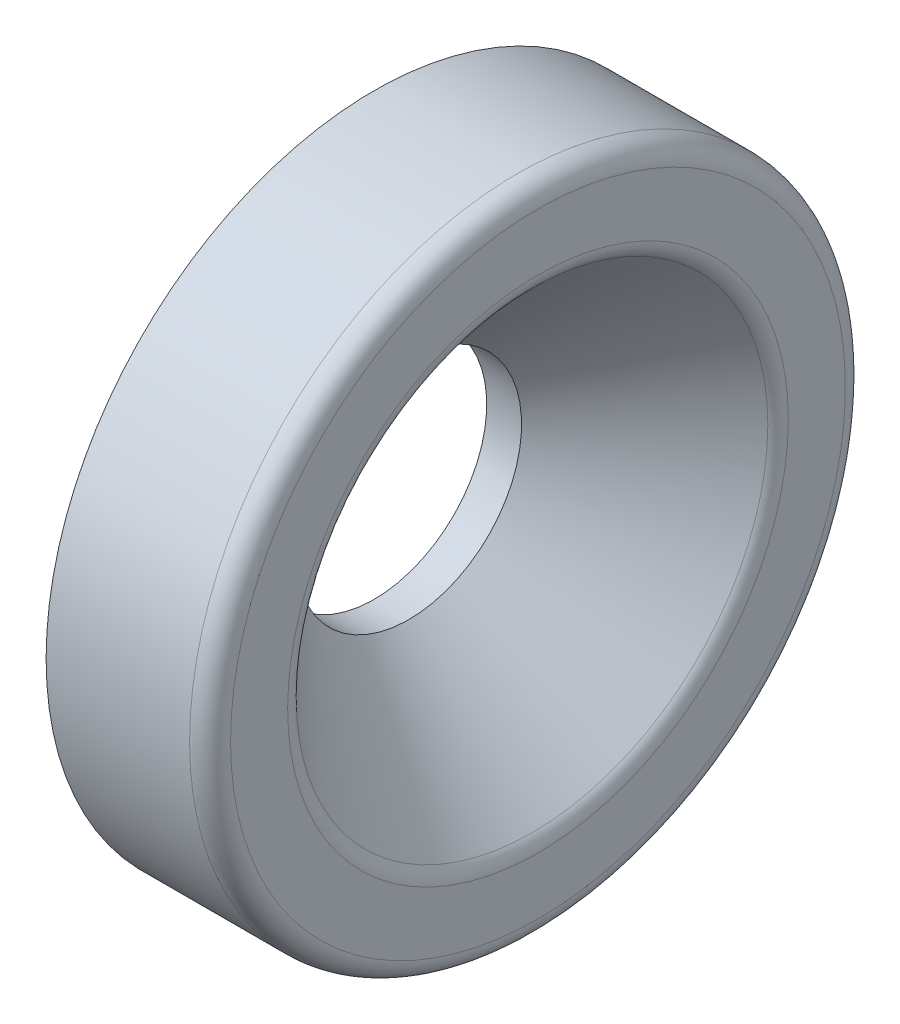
ISO-10303-21;
HEADER;
FILE_DESCRIPTION(('STEP AP214'),'2;1');
FILE_NAME('part.step','',(''),(''),'','','');
FILE_SCHEMA(('AUTOMOTIVE_DESIGN { 1 0 10303 214 1 1 1 1 }'));
ENDSEC;
DATA;
#1=APPLICATION_CONTEXT('core data for automotive mechanical design processes');
#2=APPLICATION_PROTOCOL_DEFINITION('international standard','automotive_design',2000,#1);
#3=PRODUCT_CONTEXT('',#1,'mechanical');
#4=PRODUCT('Part','Part','',(#3));
#5=PRODUCT_RELATED_PRODUCT_CATEGORY('part','',(#4));
#6=PRODUCT_DEFINITION_FORMATION('','',#4);
#7=PRODUCT_DEFINITION_CONTEXT('part definition',#1,'design');
#8=PRODUCT_DEFINITION('design','',#6,#7);
#9=PRODUCT_DEFINITION_SHAPE('','',#8);
#10=(LENGTH_UNIT() NAMED_UNIT(*) SI_UNIT(.MILLI.,.METRE.));
#11=(NAMED_UNIT(*) PLANE_ANGLE_UNIT() SI_UNIT($,.RADIAN.));
#12=(NAMED_UNIT(*) SI_UNIT($,.STERADIAN.) SOLID_ANGLE_UNIT());
#13=UNCERTAINTY_MEASURE_WITH_UNIT(LENGTH_MEASURE(1.E-05),#10,'distance_accuracy_value','');
#14=(GEOMETRIC_REPRESENTATION_CONTEXT(3) GLOBAL_UNCERTAINTY_ASSIGNED_CONTEXT((#13)) GLOBAL_UNIT_ASSIGNED_CONTEXT((#10,
#11,#12)) REPRESENTATION_CONTEXT('',''));
#15=CARTESIAN_POINT('',(0.,0.,0.));
#16=DIRECTION('',(0.,0.,1.));
#17=DIRECTION('',(1.,0.,0.));
#18=AXIS2_PLACEMENT_3D('',#15,#16,#17);
#19=CARTESIAN_POINT('',(0.,0.,0.));
#20=DIRECTION('',(-1.,0.,0.));
#21=DIRECTION('',(0.,0.,1.));
#22=AXIS2_PLACEMENT_3D('',#19,#20,#21);
#23=CYLINDRICAL_SURFACE('',#22,2.75);
#24=CARTESIAN_POINT('',(0.850000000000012,0.,0.));
#25=DIRECTION('',(-1.,0.,0.));
#26=DIRECTION('',(0.,0.,1.));
#27=AXIS2_PLACEMENT_3D('',#24,#25,#26);
#28=CIRCLE('',#27,2.75);
#29=CARTESIAN_POINT('',(0.850000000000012,0.,2.75));
#30=VERTEX_POINT('',#29);
#31=EDGE_CURVE('E62',#30,#30,#28,.T.);
#32=ORIENTED_EDGE('',*,*,#31,.F.);
#33=EDGE_LOOP('',(#32));
#34=FACE_BOUND('',#33,.T.);
#35=CARTESIAN_POINT('',(0.,0.,0.));
#36=DIRECTION('',(-1.,0.,0.));
#37=DIRECTION('',(0.,0.,1.));
#38=AXIS2_PLACEMENT_3D('',#35,#36,#37);
#39=CIRCLE('',#38,2.75);
#40=CARTESIAN_POINT('',(0.,0.,2.75));
#41=VERTEX_POINT('',#40);
#42=EDGE_CURVE('E56',#41,#41,#39,.T.);
#43=ORIENTED_EDGE('',*,*,#42,.T.);
#44=EDGE_LOOP('',(#43));
#45=FACE_BOUND('',#44,.T.);
#46=ADVANCED_FACE('F36',(#34,#45),#23,.F.);
#47=CARTESIAN_POINT('',(0.,2.75,0.));
#48=DIRECTION('',(1.,0.,0.));
#49=DIRECTION('',(0.,0.,-1.));
#50=AXIS2_PLACEMENT_3D('',#47,#48,#49);
#51=PLANE('',#50);
#52=ORIENTED_EDGE('',*,*,#42,.F.);
#53=EDGE_LOOP('',(#52));
#54=FACE_BOUND('',#53,.T.);
#55=CARTESIAN_POINT('',(0.,0.,0.));
#56=DIRECTION('',(-1.,0.,0.));
#57=DIRECTION('',(0.,0.,1.));
#58=AXIS2_PLACEMENT_3D('',#55,#56,#57);
#59=CIRCLE('',#58,8.);
#60=CARTESIAN_POINT('',(0.,0.,8.));
#61=VERTEX_POINT('',#60);
#62=EDGE_CURVE('E59',#61,#61,#59,.T.);
#63=ORIENTED_EDGE('',*,*,#62,.T.);
#64=EDGE_LOOP('',(#63));
#65=FACE_BOUND('',#64,.T.);
#66=ADVANCED_FACE('F70',(#54,#65),#51,.F.);
#67=CARTESIAN_POINT('',(0.,0.,0.));
#68=DIRECTION('',(-1.,0.,0.));
#69=DIRECTION('',(0.,0.,1.));
#70=AXIS2_PLACEMENT_3D('',#67,#68,#69);
#71=CYLINDRICAL_SURFACE('',#70,8.);
#72=CARTESIAN_POINT('',(3.5,0.,0.));
#73=DIRECTION('',(-1.,0.,0.));
#74=DIRECTION('',(0.,0.,1.));
#75=AXIS2_PLACEMENT_3D('',#72,#73,#74);
#76=CIRCLE('',#75,8.);
#77=CARTESIAN_POINT('',(3.5,0.,8.));
#78=VERTEX_POINT('',#77);
#79=EDGE_CURVE('E51',#78,#78,#76,.T.);
#80=ORIENTED_EDGE('',*,*,#79,.T.);
#81=EDGE_LOOP('',(#80));
#82=FACE_BOUND('',#81,.T.);
#83=ORIENTED_EDGE('',*,*,#62,.F.);
#84=EDGE_LOOP('',(#83));
#85=FACE_BOUND('',#84,.T.);
#86=ADVANCED_FACE('F76',(#82,#85),#71,.T.);
#87=CARTESIAN_POINT('',(4.,8.,0.));
#88=DIRECTION('',(-1.,0.,0.));
#89=DIRECTION('',(0.,0.,1.));
#90=AXIS2_PLACEMENT_3D('',#87,#88,#89);
#91=PLANE('',#90);
#92=CARTESIAN_POINT('',(4.,0.,0.));
#93=DIRECTION('',(-1.,0.,0.));
#94=DIRECTION('',(0.,0.,1.));
#95=AXIS2_PLACEMENT_3D('',#92,#93,#94);
#96=CIRCLE('',#95,7.5);
#97=CARTESIAN_POINT('',(4.,0.,7.5));
#98=VERTEX_POINT('',#97);
#99=EDGE_CURVE('E43',#98,#98,#96,.F.);
#100=ORIENTED_EDGE('',*,*,#99,.T.);
#101=EDGE_LOOP('',(#100));
#102=FACE_BOUND('',#101,.T.);
#103=CARTESIAN_POINT('',(4.,0.,0.));
#104=DIRECTION('',(-1.,0.,0.));
#105=DIRECTION('',(0.,0.,1.));
#106=AXIS2_PLACEMENT_3D('',#103,#104,#105);
#107=CIRCLE('',#106,6.10710678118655);
#108=CARTESIAN_POINT('',(4.,0.,6.10710678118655));
#109=VERTEX_POINT('',#108);
#110=EDGE_CURVE('E47',#109,#109,#107,.T.);
#111=ORIENTED_EDGE('',*,*,#110,.T.);
#112=EDGE_LOOP('',(#111));
#113=FACE_BOUND('',#112,.T.);
#114=ADVANCED_FACE('F81',(#102,#113),#91,.F.);
#115=CARTESIAN_POINT('',(0.850000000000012,0.,0.));
#116=DIRECTION('',(1.,0.,0.));
#117=DIRECTION('',(0.,0.,-1.));
#118=AXIS2_PLACEMENT_3D('',#115,#116,#117);
#119=CONICAL_SURFACE('',#118,2.75,0.78539816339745);
#120=CARTESIAN_POINT('',(3.85355339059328,0.,0.));
#121=DIRECTION('',(-1.,0.,0.));
#122=DIRECTION('',(0.,0.,1.));
#123=AXIS2_PLACEMENT_3D('',#120,#121,#122);
#124=CIRCLE('',#123,5.75355339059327);
#125=CARTESIAN_POINT('',(3.85355339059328,0.,5.75355339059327));
#126=VERTEX_POINT('',#125);
#127=EDGE_CURVE('E10',#126,#126,#124,.F.);
#128=ORIENTED_EDGE('',*,*,#127,.T.);
#129=EDGE_LOOP('',(#128));
#130=FACE_BOUND('',#129,.T.);
#131=ORIENTED_EDGE('',*,*,#31,.T.);
#132=EDGE_LOOP('',(#131));
#133=FACE_BOUND('',#132,.T.);
#134=ADVANCED_FACE('F66',(#130,#133),#119,.F.);
#135=CARTESIAN_POINT('',(3.5,0.,0.));
#136=DIRECTION('',(-1.,0.,0.));
#137=DIRECTION('',(0.,0.,1.));
#138=AXIS2_PLACEMENT_3D('',#135,#136,#137);
#139=TOROIDAL_SURFACE('',#138,7.5,0.5);
#140=ORIENTED_EDGE('',*,*,#99,.F.);
#141=EDGE_LOOP('',(#140));
#142=FACE_BOUND('',#141,.T.);
#143=ORIENTED_EDGE('',*,*,#79,.F.);
#144=EDGE_LOOP('',(#143));
#145=FACE_BOUND('',#144,.T.);
#146=ADVANCED_FACE('F89',(#142,#145),#139,.T.);
#147=CARTESIAN_POINT('',(3.5,0.,0.));
#148=DIRECTION('',(-1.,0.,0.));
#149=DIRECTION('',(0.,0.,1.));
#150=AXIS2_PLACEMENT_3D('',#147,#148,#149);
#151=TOROIDAL_SURFACE('',#150,6.10710678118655,0.5);
#152=ORIENTED_EDGE('',*,*,#127,.F.);
#153=EDGE_LOOP('',(#152));
#154=FACE_BOUND('',#153,.T.);
#155=ORIENTED_EDGE('',*,*,#110,.F.);
#156=EDGE_LOOP('',(#155));
#157=FACE_BOUND('',#156,.T.);
#158=ADVANCED_FACE('F38',(#154,#157),#151,.T.);
#159=CLOSED_SHELL('',(#46,#66,#86,#114,#134,#146,#158));
#160=MANIFOLD_SOLID_BREP('B2',#159);
#161=ADVANCED_BREP_SHAPE_REPRESENTATION('',(#18,#160),#14);
#162=SHAPE_DEFINITION_REPRESENTATION(#9,#161);
ENDSEC;
END-ISO-10303-21;
